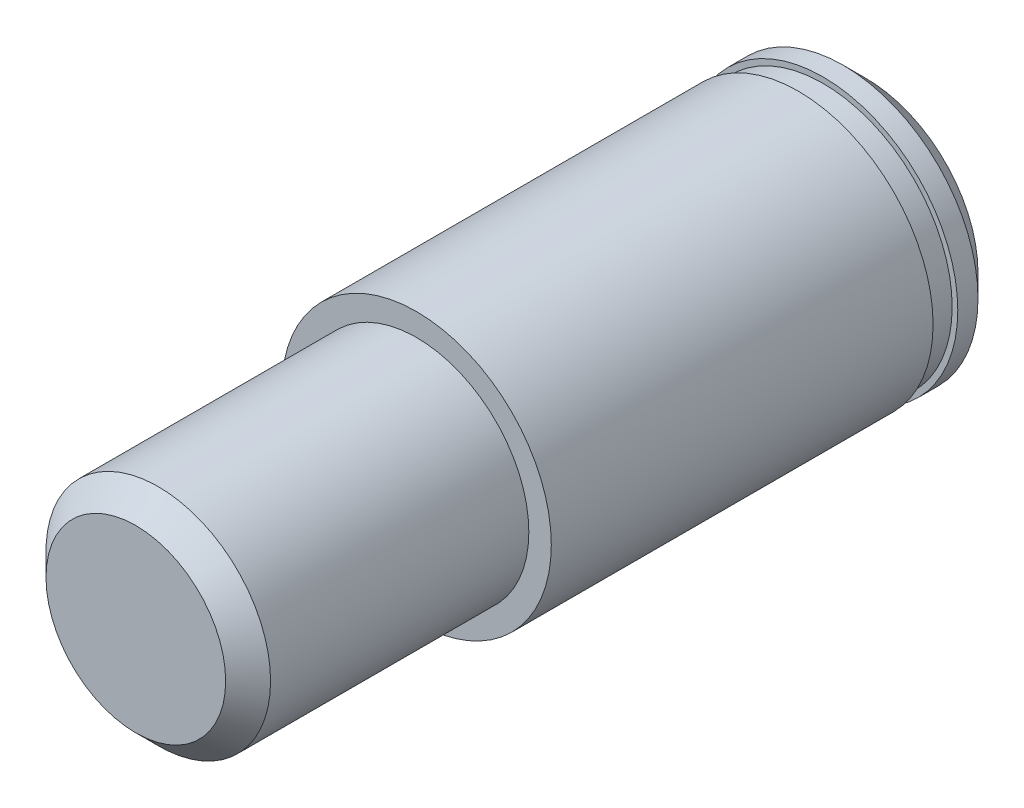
ISO-10303-21;
HEADER;
FILE_DESCRIPTION(('STEP AP214'),'2;1');
FILE_NAME('part.step','',(''),(''),'','','');
FILE_SCHEMA(('AUTOMOTIVE_DESIGN { 1 0 10303 214 1 1 1 1 }'));
ENDSEC;
DATA;
#1=APPLICATION_CONTEXT('core data for automotive mechanical design processes');
#2=APPLICATION_PROTOCOL_DEFINITION('international standard','automotive_design',2000,#1);
#3=PRODUCT_CONTEXT('',#1,'mechanical');
#4=PRODUCT('Part','Part','',(#3));
#5=PRODUCT_RELATED_PRODUCT_CATEGORY('part','',(#4));
#6=PRODUCT_DEFINITION_FORMATION('','',#4);
#7=PRODUCT_DEFINITION_CONTEXT('part definition',#1,'design');
#8=PRODUCT_DEFINITION('design','',#6,#7);
#9=PRODUCT_DEFINITION_SHAPE('','',#8);
#10=(LENGTH_UNIT() NAMED_UNIT(*) SI_UNIT(.MILLI.,.METRE.));
#11=(NAMED_UNIT(*) PLANE_ANGLE_UNIT() SI_UNIT($,.RADIAN.));
#12=(NAMED_UNIT(*) SI_UNIT($,.STERADIAN.) SOLID_ANGLE_UNIT());
#13=UNCERTAINTY_MEASURE_WITH_UNIT(LENGTH_MEASURE(1.E-05),#10,'distance_accuracy_value','');
#14=(GEOMETRIC_REPRESENTATION_CONTEXT(3) GLOBAL_UNCERTAINTY_ASSIGNED_CONTEXT((#13)) GLOBAL_UNIT_ASSIGNED_CONTEXT((#10,
#11,#12)) REPRESENTATION_CONTEXT('',''));
#15=CARTESIAN_POINT('',(0.,0.,0.));
#16=DIRECTION('',(0.,0.,1.));
#17=DIRECTION('',(1.,0.,0.));
#18=AXIS2_PLACEMENT_3D('',#15,#16,#17);
#19=CARTESIAN_POINT('',(0.,0.,20.));
#20=DIRECTION('',(0.,0.,1.));
#21=DIRECTION('',(1.,0.,0.));
#22=AXIS2_PLACEMENT_3D('',#19,#20,#21);
#23=PLANE('',#22);
#24=CARTESIAN_POINT('',(0.,0.,20.));
#25=DIRECTION('',(0.,0.,1.));
#26=DIRECTION('',(1.,0.,0.));
#27=AXIS2_PLACEMENT_3D('',#24,#25,#26);
#28=CIRCLE('',#27,6.);
#29=CARTESIAN_POINT('',(6.,0.,20.));
#30=VERTEX_POINT('',#29);
#31=EDGE_CURVE('E56',#30,#30,#28,.T.);
#32=ORIENTED_EDGE('',*,*,#31,.T.);
#33=EDGE_LOOP('',(#32));
#34=FACE_BOUND('',#33,.T.);
#35=CARTESIAN_POINT('',(0.,0.,20.));
#36=DIRECTION('',(0.,0.,1.));
#37=DIRECTION('',(1.,0.,0.));
#38=AXIS2_PLACEMENT_3D('',#35,#36,#37);
#39=CIRCLE('',#38,5.);
#40=CARTESIAN_POINT('',(5.,0.,20.));
#41=VERTEX_POINT('',#40);
#42=EDGE_CURVE('E62',#41,#41,#39,.T.);
#43=ORIENTED_EDGE('',*,*,#42,.F.);
#44=EDGE_LOOP('',(#43));
#45=FACE_BOUND('',#44,.T.);
#46=ADVANCED_FACE('F27',(#34,#45),#23,.T.);
#47=CARTESIAN_POINT('',(0.,0.,1.9));
#48=DIRECTION('',(0.,0.,1.));
#49=DIRECTION('',(1.,0.,0.));
#50=AXIS2_PLACEMENT_3D('',#47,#48,#49);
#51=PLANE('',#50);
#52=CARTESIAN_POINT('',(0.,0.,1.9));
#53=DIRECTION('',(0.,0.,1.));
#54=DIRECTION('',(1.,0.,0.));
#55=AXIS2_PLACEMENT_3D('',#52,#53,#54);
#56=CIRCLE('',#55,6.);
#57=CARTESIAN_POINT('',(-6.,0.,1.9));
#58=VERTEX_POINT('',#57);
#59=EDGE_CURVE('E47',#58,#58,#56,.T.);
#60=ORIENTED_EDGE('',*,*,#59,.T.);
#61=EDGE_LOOP('',(#60));
#62=FACE_BOUND('',#61,.T.);
#63=CARTESIAN_POINT('',(0.,0.,1.9));
#64=DIRECTION('',(0.,0.,1.));
#65=DIRECTION('',(1.,0.,0.));
#66=AXIS2_PLACEMENT_3D('',#63,#64,#65);
#67=CIRCLE('',#66,5.75);
#68=CARTESIAN_POINT('',(5.75,0.,1.9));
#69=VERTEX_POINT('',#68);
#70=EDGE_CURVE('E53',#69,#69,#67,.T.);
#71=ORIENTED_EDGE('',*,*,#70,.F.);
#72=EDGE_LOOP('',(#71));
#73=FACE_BOUND('',#72,.T.);
#74=ADVANCED_FACE('F69',(#62,#73),#51,.T.);
#75=CARTESIAN_POINT('',(0.,0.,1.9));
#76=DIRECTION('',(0.,0.,-1.));
#77=DIRECTION('',(-1.,0.,0.));
#78=AXIS2_PLACEMENT_3D('',#75,#76,#77);
#79=CYLINDRICAL_SURFACE('',#78,6.);
#80=CARTESIAN_POINT('',(0.,0.,1.00000000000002));
#81=DIRECTION('',(0.,0.,1.));
#82=DIRECTION('',(1.,0.,0.));
#83=AXIS2_PLACEMENT_3D('',#80,#81,#82);
#84=CIRCLE('',#83,6.);
#85=CARTESIAN_POINT('',(-6.,0.,1.00000000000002));
#86=VERTEX_POINT('',#85);
#87=EDGE_CURVE('E34',#86,#86,#84,.T.);
#88=CARTESIAN_POINT('',(-6.,0.,1.00000000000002));
#89=CARTESIAN_POINT('',(-6.,0.,1.00937500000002));
#90=CARTESIAN_POINT('',(-6.,0.,1.01875000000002));
#91=CARTESIAN_POINT('',(-6.,0.,1.03750000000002));
#92=CARTESIAN_POINT('',(-6.,0.,1.04687500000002));
#93=CARTESIAN_POINT('',(-6.,0.,1.06562500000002));
#94=CARTESIAN_POINT('',(-6.,0.,1.07500000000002));
#95=CARTESIAN_POINT('',(-6.,0.,1.09375000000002));
#96=CARTESIAN_POINT('',(-6.,0.,1.10312500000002));
#97=CARTESIAN_POINT('',(-6.,0.,1.12187500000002));
#98=CARTESIAN_POINT('',(-6.,0.,1.13125000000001));
#99=CARTESIAN_POINT('',(-6.,0.,1.15000000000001));
#100=CARTESIAN_POINT('',(-6.,0.,1.15937500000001));
#101=CARTESIAN_POINT('',(-6.,0.,1.17812500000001));
#102=CARTESIAN_POINT('',(-6.,0.,1.18750000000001));
#103=CARTESIAN_POINT('',(-6.,0.,1.20625000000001));
#104=CARTESIAN_POINT('',(-6.,0.,1.21562500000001));
#105=CARTESIAN_POINT('',(-6.,0.,1.23437500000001));
#106=CARTESIAN_POINT('',(-6.,0.,1.24375000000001));
#107=CARTESIAN_POINT('',(-6.,0.,1.26250000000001));
#108=CARTESIAN_POINT('',(-6.,0.,1.27187500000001));
#109=CARTESIAN_POINT('',(-6.,0.,1.29062500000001));
#110=CARTESIAN_POINT('',(-6.,0.,1.30000000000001));
#111=CARTESIAN_POINT('',(-6.,0.,1.31875000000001));
#112=CARTESIAN_POINT('',(-6.,0.,1.32812500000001));
#113=CARTESIAN_POINT('',(-6.,0.,1.34687500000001));
#114=CARTESIAN_POINT('',(-6.,0.,1.35625000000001));
#115=CARTESIAN_POINT('',(-6.,0.,1.37500000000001));
#116=CARTESIAN_POINT('',(-6.,0.,1.38437500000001));
#117=CARTESIAN_POINT('',(-6.,0.,1.40312500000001));
#118=CARTESIAN_POINT('',(-6.,0.,1.41250000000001));
#119=CARTESIAN_POINT('',(-6.,0.,1.43125000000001));
#120=CARTESIAN_POINT('',(-6.,0.,1.44062500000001));
#121=CARTESIAN_POINT('',(-6.,0.,1.45937500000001));
#122=CARTESIAN_POINT('',(-6.,0.,1.46875000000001));
#123=CARTESIAN_POINT('',(-6.,0.,1.48750000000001));
#124=CARTESIAN_POINT('',(-6.,0.,1.49687500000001));
#125=CARTESIAN_POINT('',(-6.,0.,1.51562500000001));
#126=CARTESIAN_POINT('',(-6.,0.,1.52500000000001));
#127=CARTESIAN_POINT('',(-6.,0.,1.54375000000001));
#128=CARTESIAN_POINT('',(-6.,0.,1.55312500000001));
#129=CARTESIAN_POINT('',(-6.,0.,1.57187500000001));
#130=CARTESIAN_POINT('',(-6.,0.,1.58125000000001));
#131=CARTESIAN_POINT('',(-6.,0.,1.60000000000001));
#132=CARTESIAN_POINT('',(-6.,0.,1.60937500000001));
#133=CARTESIAN_POINT('',(-6.,0.,1.62812500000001));
#134=CARTESIAN_POINT('',(-6.,0.,1.63750000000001));
#135=CARTESIAN_POINT('',(-6.,0.,1.65625));
#136=CARTESIAN_POINT('',(-6.,0.,1.665625));
#137=CARTESIAN_POINT('',(-6.,0.,1.684375));
#138=CARTESIAN_POINT('',(-6.,0.,1.69375));
#139=CARTESIAN_POINT('',(-6.,0.,1.7125));
#140=CARTESIAN_POINT('',(-6.,0.,1.721875));
#141=CARTESIAN_POINT('',(-6.,0.,1.740625));
#142=CARTESIAN_POINT('',(-6.,0.,1.75));
#143=CARTESIAN_POINT('',(-6.,0.,1.76875));
#144=CARTESIAN_POINT('',(-6.,0.,1.778125));
#145=CARTESIAN_POINT('',(-6.,0.,1.796875));
#146=CARTESIAN_POINT('',(-6.,0.,1.80625));
#147=CARTESIAN_POINT('',(-6.,0.,1.825));
#148=CARTESIAN_POINT('',(-6.,0.,1.834375));
#149=CARTESIAN_POINT('',(-6.,0.,1.853125));
#150=CARTESIAN_POINT('',(-6.,0.,1.8625));
#151=CARTESIAN_POINT('',(-6.,0.,1.88125));
#152=CARTESIAN_POINT('',(-6.,0.,1.890625));
#153=CARTESIAN_POINT('',(-6.,0.,1.9));
#154=B_SPLINE_CURVE_WITH_KNOTS('',3,(#88,#89,#90,#91,#92,#93,#94,#95,#96,#97,#98,#99,#100,#101,
#102,#103,#104,#105,#106,#107,#108,#109,#110,#111,#112,#113,#114,#115,#116,#117,#118,#119,#120,
#121,#122,#123,#124,#125,#126,#127,#128,#129,#130,#131,#132,#133,#134,#135,#136,#137,#138,#139,
#140,#141,#142,#143,#144,#145,#146,#147,#148,#149,#150,#151,#152,#153),.UNSPECIFIED.,.F.,.F.,(4,
2,2,2,2,2,2,2,2,2,2,2,2,2,2,2,2,2,2,2,2,2,2,2,2,2,2,2,2,2,2,2,4),(0.,0.0281249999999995,
0.056249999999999,0.0843749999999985,0.112499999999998,0.140624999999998,0.168749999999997,
0.196874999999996,0.224999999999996,0.253124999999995,0.281249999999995,0.309374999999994,
0.337499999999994,0.365624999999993,0.393749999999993,0.421874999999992,0.449999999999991,
0.478124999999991,0.50624999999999,0.53437499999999,0.562499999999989,0.590624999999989,
0.618749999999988,0.646874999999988,0.674999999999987,0.703124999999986,0.731249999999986,
0.759374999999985,0.787499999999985,0.815624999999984,0.843749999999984,0.871874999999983,
0.899999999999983),.UNSPECIFIED.);
#155=EDGE_CURVE('BSEAM29',#86,#58,#154,.T.);
#156=ORIENTED_EDGE('',*,*,#87,.T.);
#157=ORIENTED_EDGE('',*,*,#59,.F.);
#158=ORIENTED_EDGE('',*,*,#155,.T.);
#159=ORIENTED_EDGE('',*,*,#155,.F.);
#160=EDGE_LOOP('',(#156,#158,#157,#159));
#161=FACE_BOUND('',#160,.T.);
#162=ADVANCED_FACE('F29',(#161),#79,.T.);
#163=CARTESIAN_POINT('',(0.,0.,0.));
#164=DIRECTION('',(0.,0.,1.));
#165=DIRECTION('',(1.,0.,0.));
#166=AXIS2_PLACEMENT_3D('',#163,#164,#165);
#167=PLANE('',#166);
#168=CARTESIAN_POINT('',(0.,0.,0.));
#169=DIRECTION('',(0.,0.,1.));
#170=DIRECTION('',(1.,0.,0.));
#171=AXIS2_PLACEMENT_3D('',#168,#169,#170);
#172=CIRCLE('',#171,4.99999999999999);
#173=CARTESIAN_POINT('',(4.99999999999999,0.,0.));
#174=VERTEX_POINT('',#173);
#175=EDGE_CURVE('E10',#174,#174,#172,.F.);
#176=ORIENTED_EDGE('',*,*,#175,.T.);
#177=EDGE_LOOP('',(#176));
#178=FACE_BOUND('',#177,.T.);
#179=ADVANCED_FACE('F87',(#178),#167,.F.);
#180=CARTESIAN_POINT('',(0.,0.,3.));
#181=DIRECTION('',(0.,0.,-1.));
#182=DIRECTION('',(-1.,0.,0.));
#183=AXIS2_PLACEMENT_3D('',#180,#181,#182);
#184=CYLINDRICAL_SURFACE('',#183,5.75);
#185=CARTESIAN_POINT('',(0.,0.,3.));
#186=DIRECTION('',(0.,0.,1.));
#187=DIRECTION('',(1.,0.,0.));
#188=AXIS2_PLACEMENT_3D('',#185,#186,#187);
#189=CIRCLE('',#188,5.75);
#190=CARTESIAN_POINT('',(5.75,0.,3.));
#191=VERTEX_POINT('',#190);
#192=EDGE_CURVE('E50',#191,#191,#189,.T.);
#193=ORIENTED_EDGE('',*,*,#192,.F.);
#194=EDGE_LOOP('',(#193));
#195=FACE_BOUND('',#194,.T.);
#196=ORIENTED_EDGE('',*,*,#70,.T.);
#197=EDGE_LOOP('',(#196));
#198=FACE_BOUND('',#197,.T.);
#199=ADVANCED_FACE('F84',(#195,#198),#184,.T.);
#200=CARTESIAN_POINT('',(0.,0.,3.));
#201=DIRECTION('',(0.,0.,1.));
#202=DIRECTION('',(1.,0.,0.));
#203=AXIS2_PLACEMENT_3D('',#200,#201,#202);
#204=PLANE('',#203);
#205=CARTESIAN_POINT('',(0.,0.,3.));
#206=DIRECTION('',(0.,0.,1.));
#207=DIRECTION('',(1.,0.,0.));
#208=AXIS2_PLACEMENT_3D('',#205,#206,#207);
#209=CIRCLE('',#208,6.);
#210=CARTESIAN_POINT('',(6.,0.,3.));
#211=VERTEX_POINT('',#210);
#212=EDGE_CURVE('E59',#211,#211,#209,.T.);
#213=ORIENTED_EDGE('',*,*,#212,.F.);
#214=EDGE_LOOP('',(#213));
#215=FACE_BOUND('',#214,.T.);
#216=ORIENTED_EDGE('',*,*,#192,.T.);
#217=EDGE_LOOP('',(#216));
#218=FACE_BOUND('',#217,.T.);
#219=ADVANCED_FACE('F78',(#215,#218),#204,.F.);
#220=CARTESIAN_POINT('',(0.,0.,20.));
#221=DIRECTION('',(0.,0.,-1.));
#222=DIRECTION('',(-1.,0.,0.));
#223=AXIS2_PLACEMENT_3D('',#220,#221,#222);
#224=CYLINDRICAL_SURFACE('',#223,6.);
#225=ORIENTED_EDGE('',*,*,#31,.F.);
#226=EDGE_LOOP('',(#225));
#227=FACE_BOUND('',#226,.T.);
#228=ORIENTED_EDGE('',*,*,#212,.T.);
#229=EDGE_LOOP('',(#228));
#230=FACE_BOUND('',#229,.T.);
#231=ADVANCED_FACE('F80',(#227,#230),#224,.T.);
#232=CARTESIAN_POINT('',(0.,0.,32.5));
#233=DIRECTION('',(0.,0.,-1.));
#234=DIRECTION('',(-1.,0.,0.));
#235=AXIS2_PLACEMENT_3D('',#232,#233,#234);
#236=CYLINDRICAL_SURFACE('',#235,5.);
#237=CARTESIAN_POINT('',(0.,0.,31.5));
#238=DIRECTION('',(0.,0.,1.));
#239=DIRECTION('',(1.,0.,0.));
#240=AXIS2_PLACEMENT_3D('',#237,#238,#239);
#241=CIRCLE('',#240,5.);
#242=CARTESIAN_POINT('',(5.,0.,31.5));
#243=VERTEX_POINT('',#242);
#244=EDGE_CURVE('E38',#243,#243,#241,.F.);
#245=ORIENTED_EDGE('',*,*,#244,.T.);
#246=EDGE_LOOP('',(#245));
#247=FACE_BOUND('',#246,.T.);
#248=ORIENTED_EDGE('',*,*,#42,.T.);
#249=EDGE_LOOP('',(#248));
#250=FACE_BOUND('',#249,.T.);
#251=ADVANCED_FACE('F66',(#247,#250),#236,.T.);
#252=CARTESIAN_POINT('',(0.,0.,32.5));
#253=DIRECTION('',(0.,0.,1.));
#254=DIRECTION('',(1.,0.,0.));
#255=AXIS2_PLACEMENT_3D('',#252,#253,#254);
#256=PLANE('',#255);
#257=CARTESIAN_POINT('',(0.,0.,32.5));
#258=DIRECTION('',(0.,0.,1.));
#259=DIRECTION('',(1.,0.,0.));
#260=AXIS2_PLACEMENT_3D('',#257,#258,#259);
#261=CIRCLE('',#260,3.99999999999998);
#262=CARTESIAN_POINT('',(3.99999999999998,0.,32.5));
#263=VERTEX_POINT('',#262);
#264=EDGE_CURVE('E42',#263,#263,#261,.T.);
#265=ORIENTED_EDGE('',*,*,#264,.T.);
#266=EDGE_LOOP('',(#265));
#267=FACE_BOUND('',#266,.T.);
#268=ADVANCED_FACE('F139',(#267),#256,.T.);
#269=CARTESIAN_POINT('',(0.,0.,32.5));
#270=DIRECTION('',(0.,0.,-1.));
#271=DIRECTION('',(-1.,0.,0.));
#272=AXIS2_PLACEMENT_3D('',#269,#270,#271);
#273=CONICAL_SURFACE('',#272,3.99999999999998,0.785398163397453);
#274=ORIENTED_EDGE('',*,*,#244,.F.);
#275=EDGE_LOOP('',(#274));
#276=FACE_BOUND('',#275,.T.);
#277=ORIENTED_EDGE('',*,*,#264,.F.);
#278=EDGE_LOOP('',(#277));
#279=FACE_BOUND('',#278,.T.);
#280=ADVANCED_FACE('F147',(#276,#279),#273,.T.);
#281=CARTESIAN_POINT('',(0.,0.,1.00000000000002));
#282=DIRECTION('',(0.,0.,1.));
#283=DIRECTION('',(1.,0.,0.));
#284=AXIS2_PLACEMENT_3D('',#281,#282,#283);
#285=CONICAL_SURFACE('',#284,6.,0.785398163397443);
#286=ORIENTED_EDGE('',*,*,#175,.F.);
#287=EDGE_LOOP('',(#286));
#288=FACE_BOUND('',#287,.T.);
#289=ORIENTED_EDGE('',*,*,#87,.F.);
#290=EDGE_LOOP('',(#289));
#291=FACE_BOUND('',#290,.T.);
#292=ADVANCED_FACE('F156',(#288,#291),#285,.T.);
#293=CLOSED_SHELL('',(#46,#74,#162,#179,#199,#219,#231,#251,#268,#280,#292));
#294=MANIFOLD_SOLID_BREP('B2',#293);
#295=ADVANCED_BREP_SHAPE_REPRESENTATION('',(#18,#294),#14);
#296=SHAPE_DEFINITION_REPRESENTATION(#9,#295);
ENDSEC;
END-ISO-10303-21;
